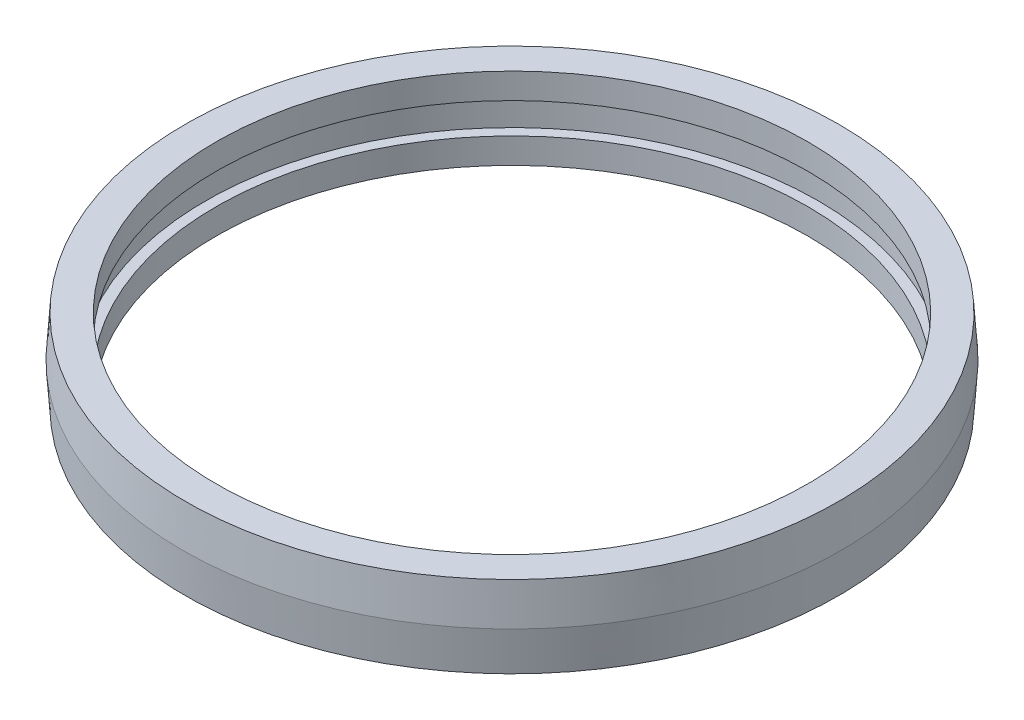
ISO-10303-21;
HEADER;
FILE_DESCRIPTION(('STEP AP214'),'2;1');
FILE_NAME('part.step','',(''),(''),'','','');
FILE_SCHEMA(('AUTOMOTIVE_DESIGN { 1 0 10303 214 1 1 1 1 }'));
ENDSEC;
DATA;
#1=APPLICATION_CONTEXT('core data for automotive mechanical design processes');
#2=APPLICATION_PROTOCOL_DEFINITION('international standard','automotive_design',2000,#1);
#3=PRODUCT_CONTEXT('',#1,'mechanical');
#4=PRODUCT('Part','Part','',(#3));
#5=PRODUCT_RELATED_PRODUCT_CATEGORY('part','',(#4));
#6=PRODUCT_DEFINITION_FORMATION('','',#4);
#7=PRODUCT_DEFINITION_CONTEXT('part definition',#1,'design');
#8=PRODUCT_DEFINITION('design','',#6,#7);
#9=PRODUCT_DEFINITION_SHAPE('','',#8);
#10=(LENGTH_UNIT() NAMED_UNIT(*) SI_UNIT(.MILLI.,.METRE.));
#11=(NAMED_UNIT(*) PLANE_ANGLE_UNIT() SI_UNIT($,.RADIAN.));
#12=(NAMED_UNIT(*) SI_UNIT($,.STERADIAN.) SOLID_ANGLE_UNIT());
#13=UNCERTAINTY_MEASURE_WITH_UNIT(LENGTH_MEASURE(1.E-05),#10,'distance_accuracy_value','');
#14=(GEOMETRIC_REPRESENTATION_CONTEXT(3) GLOBAL_UNCERTAINTY_ASSIGNED_CONTEXT((#13)) GLOBAL_UNIT_ASSIGNED_CONTEXT((#10,
#11,#12)) REPRESENTATION_CONTEXT('',''));
#15=CARTESIAN_POINT('',(0.,0.,0.));
#16=DIRECTION('',(0.,0.,1.));
#17=DIRECTION('',(1.,0.,0.));
#18=AXIS2_PLACEMENT_3D('',#15,#16,#17);
#19=CARTESIAN_POINT('',(0.,0.,0.));
#20=DIRECTION('',(0.,-1.,0.));
#21=DIRECTION('',(0.,0.,-1.));
#22=AXIS2_PLACEMENT_3D('',#19,#20,#21);
#23=CYLINDRICAL_SURFACE('',#22,92.075);
#24=CARTESIAN_POINT('',(0.,-4.76249999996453,0.));
#25=DIRECTION('',(0.,-1.,0.));
#26=DIRECTION('',(0.,0.,-1.));
#27=AXIS2_PLACEMENT_3D('',#24,#25,#26);
#28=CIRCLE('',#27,92.075);
#29=CARTESIAN_POINT('',(0.,-4.76249999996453,-92.075));
#30=VERTEX_POINT('',#29);
#31=EDGE_CURVE('E10',#30,#30,#28,.T.);
#32=ORIENTED_EDGE('',*,*,#31,.F.);
#33=EDGE_LOOP('',(#32));
#34=FACE_BOUND('',#33,.T.);
#35=CARTESIAN_POINT('',(0.,-12.6999999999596,0.));
#36=DIRECTION('',(0.,-1.,0.));
#37=DIRECTION('',(0.,0.,-1.));
#38=AXIS2_PLACEMENT_3D('',#35,#36,#37);
#39=CIRCLE('',#38,92.075);
#40=CARTESIAN_POINT('',(0.,-12.6999999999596,-92.075));
#41=VERTEX_POINT('',#40);
#42=EDGE_CURVE('E66',#41,#41,#39,.T.);
#43=ORIENTED_EDGE('',*,*,#42,.T.);
#44=EDGE_LOOP('',(#43));
#45=FACE_BOUND('',#44,.T.);
#46=ADVANCED_FACE('F35',(#34,#45),#23,.F.);
#47=CARTESIAN_POINT('',(-92.075,-4.76249999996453,0.));
#48=DIRECTION('',(0.,-1.,0.));
#49=DIRECTION('',(0.,0.,-1.));
#50=AXIS2_PLACEMENT_3D('',#47,#48,#49);
#51=PLANE('',#50);
#52=CARTESIAN_POINT('',(0.,-4.76249999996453,0.));
#53=DIRECTION('',(0.,-1.,0.));
#54=DIRECTION('',(0.,0.,-1.));
#55=AXIS2_PLACEMENT_3D('',#52,#53,#54);
#56=CIRCLE('',#55,95.25);
#57=CARTESIAN_POINT('',(0.,-4.76249999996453,-95.25));
#58=VERTEX_POINT('',#57);
#59=EDGE_CURVE('E41',#58,#58,#56,.T.);
#60=ORIENTED_EDGE('',*,*,#59,.F.);
#61=EDGE_LOOP('',(#60));
#62=FACE_BOUND('',#61,.T.);
#63=ORIENTED_EDGE('',*,*,#31,.T.);
#64=EDGE_LOOP('',(#63));
#65=FACE_BOUND('',#64,.T.);
#66=ADVANCED_FACE('F109',(#62,#65),#51,.F.);
#67=CARTESIAN_POINT('',(0.,0.,0.));
#68=DIRECTION('',(0.,-1.,0.));
#69=DIRECTION('',(0.,0.,-1.));
#70=AXIS2_PLACEMENT_3D('',#67,#68,#69);
#71=CYLINDRICAL_SURFACE('',#70,95.25);
#72=CARTESIAN_POINT('',(0.,4.76250000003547,0.));
#73=DIRECTION('',(0.,-1.,0.));
#74=DIRECTION('',(0.,0.,-1.));
#75=AXIS2_PLACEMENT_3D('',#72,#73,#74);
#76=CIRCLE('',#75,95.25);
#77=CARTESIAN_POINT('',(0.,4.76250000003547,-95.25));
#78=VERTEX_POINT('',#77);
#79=EDGE_CURVE('E45',#78,#78,#76,.T.);
#80=ORIENTED_EDGE('',*,*,#79,.F.);
#81=EDGE_LOOP('',(#80));
#82=FACE_BOUND('',#81,.T.);
#83=ORIENTED_EDGE('',*,*,#59,.T.);
#84=EDGE_LOOP('',(#83));
#85=FACE_BOUND('',#84,.T.);
#86=ADVANCED_FACE('F104',(#82,#85),#71,.F.);
#87=CARTESIAN_POINT('',(-95.25,4.76250000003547,0.));
#88=DIRECTION('',(0.,1.,0.));
#89=DIRECTION('',(0.,0.,1.));
#90=AXIS2_PLACEMENT_3D('',#87,#88,#89);
#91=PLANE('',#90);
#92=CARTESIAN_POINT('',(0.,4.76250000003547,0.));
#93=DIRECTION('',(0.,-1.,0.));
#94=DIRECTION('',(0.,0.,-1.));
#95=AXIS2_PLACEMENT_3D('',#92,#93,#94);
#96=CIRCLE('',#95,92.075);
#97=CARTESIAN_POINT('',(0.,4.76250000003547,-92.075));
#98=VERTEX_POINT('',#97);
#99=EDGE_CURVE('E49',#98,#98,#96,.T.);
#100=ORIENTED_EDGE('',*,*,#99,.F.);
#101=EDGE_LOOP('',(#100));
#102=FACE_BOUND('',#101,.T.);
#103=ORIENTED_EDGE('',*,*,#79,.T.);
#104=EDGE_LOOP('',(#103));
#105=FACE_BOUND('',#104,.T.);
#106=ADVANCED_FACE('F98',(#102,#105),#91,.F.);
#107=CARTESIAN_POINT('',(0.,0.,0.));
#108=DIRECTION('',(0.,-1.,0.));
#109=DIRECTION('',(0.,0.,-1.));
#110=AXIS2_PLACEMENT_3D('',#107,#108,#109);
#111=CYLINDRICAL_SURFACE('',#110,92.075);
#112=CARTESIAN_POINT('',(0.,12.7000000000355,0.));
#113=DIRECTION('',(0.,-1.,0.));
#114=DIRECTION('',(0.,0.,-1.));
#115=AXIS2_PLACEMENT_3D('',#112,#113,#114);
#116=CIRCLE('',#115,92.075);
#117=CARTESIAN_POINT('',(0.,12.7000000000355,-92.075));
#118=VERTEX_POINT('',#117);
#119=EDGE_CURVE('E54',#118,#118,#116,.T.);
#120=ORIENTED_EDGE('',*,*,#119,.F.);
#121=EDGE_LOOP('',(#120));
#122=FACE_BOUND('',#121,.T.);
#123=ORIENTED_EDGE('',*,*,#99,.T.);
#124=EDGE_LOOP('',(#123));
#125=FACE_BOUND('',#124,.T.);
#126=ADVANCED_FACE('F92',(#122,#125),#111,.F.);
#127=CARTESIAN_POINT('',(-92.075,12.7000000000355,0.));
#128=DIRECTION('',(0.,-1.,0.));
#129=DIRECTION('',(0.,0.,-1.));
#130=AXIS2_PLACEMENT_3D('',#127,#128,#129);
#131=PLANE('',#130);
#132=CARTESIAN_POINT('',(0.,12.7000000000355,0.));
#133=DIRECTION('',(0.,-1.,0.));
#134=DIRECTION('',(0.,0.,-1.));
#135=AXIS2_PLACEMENT_3D('',#132,#133,#134);
#136=CIRCLE('',#135,101.599999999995);
#137=CARTESIAN_POINT('',(0.,12.7000000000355,-101.599999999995));
#138=VERTEX_POINT('',#137);
#139=EDGE_CURVE('E57',#138,#138,#136,.T.);
#140=ORIENTED_EDGE('',*,*,#139,.F.);
#141=EDGE_LOOP('',(#140));
#142=FACE_BOUND('',#141,.T.);
#143=ORIENTED_EDGE('',*,*,#119,.T.);
#144=EDGE_LOOP('',(#143));
#145=FACE_BOUND('',#144,.T.);
#146=ADVANCED_FACE('F86',(#142,#145),#131,.F.);
#147=CARTESIAN_POINT('',(0.,12.7000000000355,0.));
#148=DIRECTION('',(0.,-1.,0.));
#149=DIRECTION('',(0.,0.,-1.));
#150=AXIS2_PLACEMENT_3D('',#147,#148,#149);
#151=CONICAL_SURFACE('',#150,101.599999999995,0.0698131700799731);
#152=CARTESIAN_POINT('',(0.,0.,0.));
#153=DIRECTION('',(0.,-1.,0.));
#154=DIRECTION('',(0.,0.,-1.));
#155=AXIS2_PLACEMENT_3D('',#152,#153,#154);
#156=CIRCLE('',#155,102.488070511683);
#157=CARTESIAN_POINT('',(0.,0.,-102.488070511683));
#158=VERTEX_POINT('',#157);
#159=EDGE_CURVE('E60',#158,#158,#156,.T.);
#160=ORIENTED_EDGE('',*,*,#159,.F.);
#161=EDGE_LOOP('',(#160));
#162=FACE_BOUND('',#161,.T.);
#163=ORIENTED_EDGE('',*,*,#139,.T.);
#164=EDGE_LOOP('',(#163));
#165=FACE_BOUND('',#164,.T.);
#166=ADVANCED_FACE('F80',(#162,#165),#151,.T.);
#167=CARTESIAN_POINT('',(0.,0.,0.));
#168=DIRECTION('',(0.,1.,0.));
#169=DIRECTION('',(0.,0.,1.));
#170=AXIS2_PLACEMENT_3D('',#167,#168,#169);
#171=CONICAL_SURFACE('',#170,102.488070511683,0.0698131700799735);
#172=CARTESIAN_POINT('',(0.,-12.6999999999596,0.));
#173=DIRECTION('',(0.,-1.,0.));
#174=DIRECTION('',(0.,0.,-1.));
#175=AXIS2_PLACEMENT_3D('',#172,#173,#174);
#176=CIRCLE('',#175,101.600000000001);
#177=CARTESIAN_POINT('',(0.,-12.6999999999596,-101.600000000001));
#178=VERTEX_POINT('',#177);
#179=EDGE_CURVE('E63',#178,#178,#176,.T.);
#180=ORIENTED_EDGE('',*,*,#179,.F.);
#181=EDGE_LOOP('',(#180));
#182=FACE_BOUND('',#181,.T.);
#183=ORIENTED_EDGE('',*,*,#159,.T.);
#184=EDGE_LOOP('',(#183));
#185=FACE_BOUND('',#184,.T.);
#186=ADVANCED_FACE('F74',(#182,#185),#171,.T.);
#187=CARTESIAN_POINT('',(-101.600000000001,-12.6999999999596,0.));
#188=DIRECTION('',(0.,1.,0.));
#189=DIRECTION('',(0.,0.,1.));
#190=AXIS2_PLACEMENT_3D('',#187,#188,#189);
#191=PLANE('',#190);
#192=ORIENTED_EDGE('',*,*,#42,.F.);
#193=EDGE_LOOP('',(#192));
#194=FACE_BOUND('',#193,.T.);
#195=ORIENTED_EDGE('',*,*,#179,.T.);
#196=EDGE_LOOP('',(#195));
#197=FACE_BOUND('',#196,.T.);
#198=ADVANCED_FACE('F71',(#194,#197),#191,.F.);
#199=CLOSED_SHELL('',(#46,#66,#86,#106,#126,#146,#166,#186,#198));
#200=MANIFOLD_SOLID_BREP('B2',#199);
#201=ADVANCED_BREP_SHAPE_REPRESENTATION('',(#18,#200),#14);
#202=SHAPE_DEFINITION_REPRESENTATION(#9,#201);
ENDSEC;
END-ISO-10303-21;
